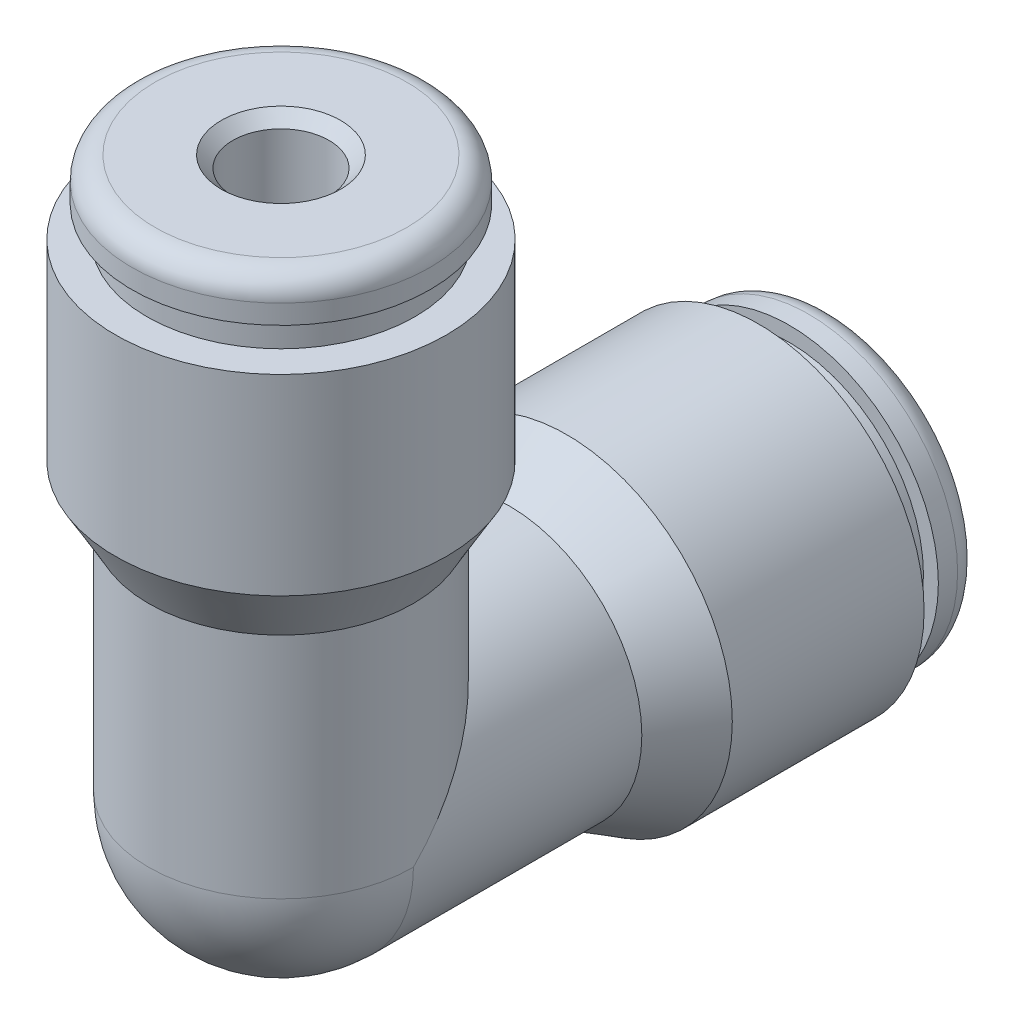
from build123d import *

# Parameters (mm, degrees)
SKETCH9_R           = 3.175
SKETCH9_R_2         = 2.413
EXTRUDE1_DEPTH      = 4.3688
CIRPATTERN2_COUNT   = 2
CIRPATTERN2_ANGLE   = 90
SKETCH12_R          = 2.413
CUT_EXTRUDE1_DEPTH  = 27.257691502
SKETCH13_R          = 2.413
CUT_EXTRUDE2_DEPTH  = 27.257691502
REVOLVE2_ANGLE      = 90
EXTRUDE2_REACH      = 25.449
EXTRUDE2_END_RADIUS = 2.413
SKETCH15_R          = 2.413
SKETCH15_R_2        = 0.8255
SKETCH14_R          = 3.556
SKETCH14_R_2        = 1.5875
EXTRUDE3_DEPTH      = 13.7922
CHAMFER1_SIZE       = 0.381


with BuildPart() as part:
    # Sketch8 → Revolve1 (revolve)
    with BuildSketch(Plane(origin=(0, 0, 0), x_dir=(0, 0, -1), z_dir=(1, 0, 0)), mode=Mode.PRIVATE) as revolve1_sk:
        with BuildLine():
            Line((16.764, 4.9149), (17.399, 4.9149))
            ThreePointArc((17.399, 4.9149), (17.937815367, 4.691715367), (18.161, 4.1529))
            Line((18.161, 4.1529), (18.161, 3.556))
            Line((18.161, 3.556), (17.78, 3.175))
            Line((17.78, 3.175), (0, 3.175))
            Line((0, 3.175), (0, 4.3688))
            Line((0, 4.3688), (7.5311, 4.3688))
            Line((7.5311, 4.3688), (9.422845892, 5.461))
            Line((9.422845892, 5.461), (15.748, 5.461))
            Line((15.748, 5.461), (15.748, 4.42341))
            Line((15.748, 4.42341), (16.764, 4.42341))
            Line((16.764, 4.42341), (16.764, 4.9149))
        make_face()
    revolve(revolve1_sk.sketch.rotate(Axis((0, 0, 0), (0, 0, -1)), 90), axis=Axis((0, 0, 0), (0, 0, -1)))

    # Sketch9 → Extrude1 (add)
    with BuildSketch(Plane.XY):
        Circle(SKETCH9_R)
        Circle(SKETCH9_R_2, mode=Mode.SUBTRACT)
    extrude(amount=-EXTRUDE1_DEPTH)


with BuildPart() as cirpattern2_1:
    # CirPattern2: pattern copy
    add(part.part.rotate(Axis((8.541818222, 0, 0), (1, 0, 0)), 1 * CIRPATTERN2_ANGLE / (CIRPATTERN2_COUNT - 1)))

    # Sketch13 → Cut-Extrude2 (cut, through all)
    with BuildSketch(Plane.XY):
        Circle(SKETCH13_R)
    extrude(amount=-CUT_EXTRUDE2_DEPTH, mode=Mode.SUBTRACT)


with BuildPart() as part_1:
    add(part.part)

    # Sketch12 → Cut-Extrude1 (cut, through all)
    with BuildSketch(Plane(origin=(0, 0, 0), x_dir=(1, 0, 0), z_dir=(0, 1, 0))):
        Circle(SKETCH12_R)
    extrude(amount=CUT_EXTRUDE1_DEPTH, mode=Mode.SUBTRACT)

    # Sketch11 → Revolve2 (revolve)
    with BuildSketch(Plane.XY):
        with BuildLine():
            Line((-4.3688, 0), (-2.413, 0))
            ThreePointArc((-2.413, 0), (0, -2.413), (2.413, 0))
            Line((2.413, 0), (4.3688, 0))
            ThreePointArc((4.3688, 0), (0, -4.3688), (-4.3688, 0))
        make_face()
    revolve(axis=Axis((-4.3688, 0, 0), (-1, 0, 0)), revolution_arc=REVOLVE2_ANGLE)

    # Combine1: union CirPattern2_1
    add(cirpattern2_1.part)

    # Extrude2: up to this cylinder (the profile starts outside it)
    extrude2_end = Plane(origin=(0, 0, 0), z_dir=(0, 0, 1)) * Cylinder(EXTRUDE2_END_RADIUS, 56.724, mode=Mode.PRIVATE)
    # Sketch15 → Extrude2 (add, up to the surface)
    with BuildSketch(Plane(origin=(0, 4.3688, 0), x_dir=(-1, 0, 0), z_dir=(0, 1, 0)), mode=Mode.PRIVATE) as extrude2_sk1:
        Circle(SKETCH15_R)
        with Locations(Location((0, 0, 0), (0, 0, 90))):
            Circle(SKETCH15_R_2, mode=Mode.SUBTRACT)
    extrude2_tool1 = extrude(extrude2_sk1.sketch, amount=-EXTRUDE2_REACH, mode=Mode.PRIVATE) - extrude2_end
    add(extrude2_tool1.solids().sort_by_distance((2.34475, 4.3688, 0))[0])

    # Sketch14 → Extrude3 (add)
    with BuildSketch(Plane(origin=(0, 4.3688, 0), x_dir=(-1, 0, 0), z_dir=(0, 1, 0))):
        Circle(SKETCH14_R)
        with Locations(Location((0, 0, 0), (0, 0, 270))):
            Circle(SKETCH14_R_2, mode=Mode.SUBTRACT)
    extrude(amount=EXTRUDE3_DEPTH)

    # Chamfer1
    chamfer1_edges = [part_1.edges().sort_by_distance(p)[0] for p in [
        (0, 18.161, 1.5875),
    ]]
    chamfer(chamfer1_edges, length=CHAMFER1_SIZE)


solid = part_1.part
